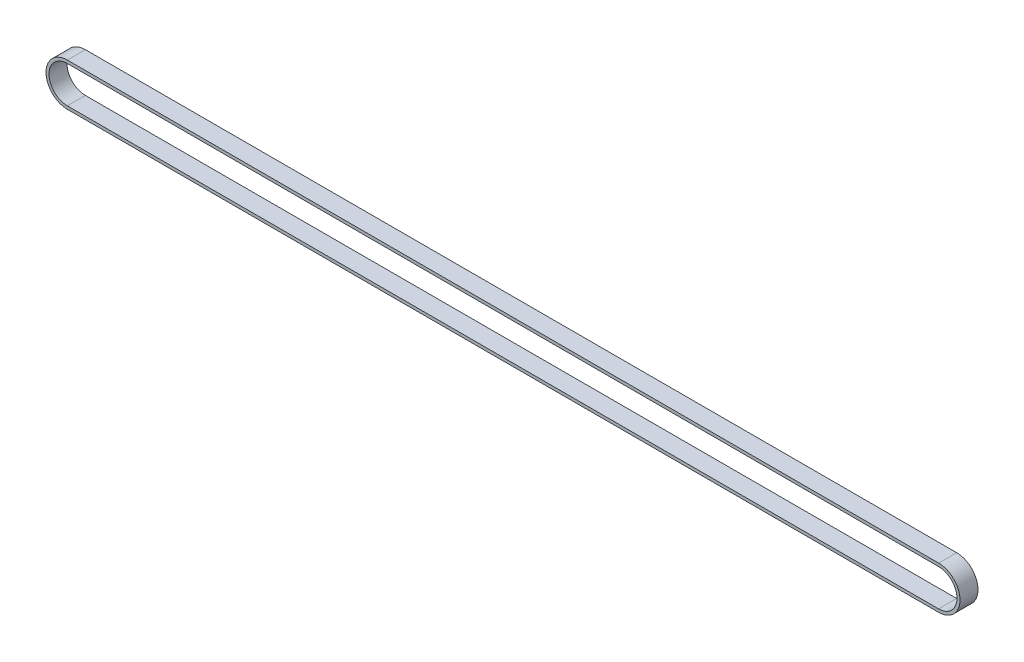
from build123d import *

# Parameters (mm, degrees)
EXTRUDE_1_DEPTH = 6


with BuildPart() as part:
    # Sketch 1 → Extrude 1 (new body)
    with BuildSketch(Plane.XY):
        with BuildLine():
            Line((0, 7.1), (290, 7.1))
            ThreePointArc((290, 7.1), (297.1, 0), (290, -7.1))
            Line((290, -7.1), (0, -7.1))
            ThreePointArc((0, -7.1), (-7.1, 0), (0, 7.1))
        make_face()
        with BuildLine():
            Line((0, 6.1), (290, 6.1))
            ThreePointArc((290, 6.1), (296.1, 0), (290, -6.1))
            Line((290, -6.1), (0, -6.1))
            ThreePointArc((0, -6.1), (-6.1, 0), (0, 6.1))
        make_face(mode=Mode.SUBTRACT)
    extrude(amount=EXTRUDE_1_DEPTH)


solid = part.part
